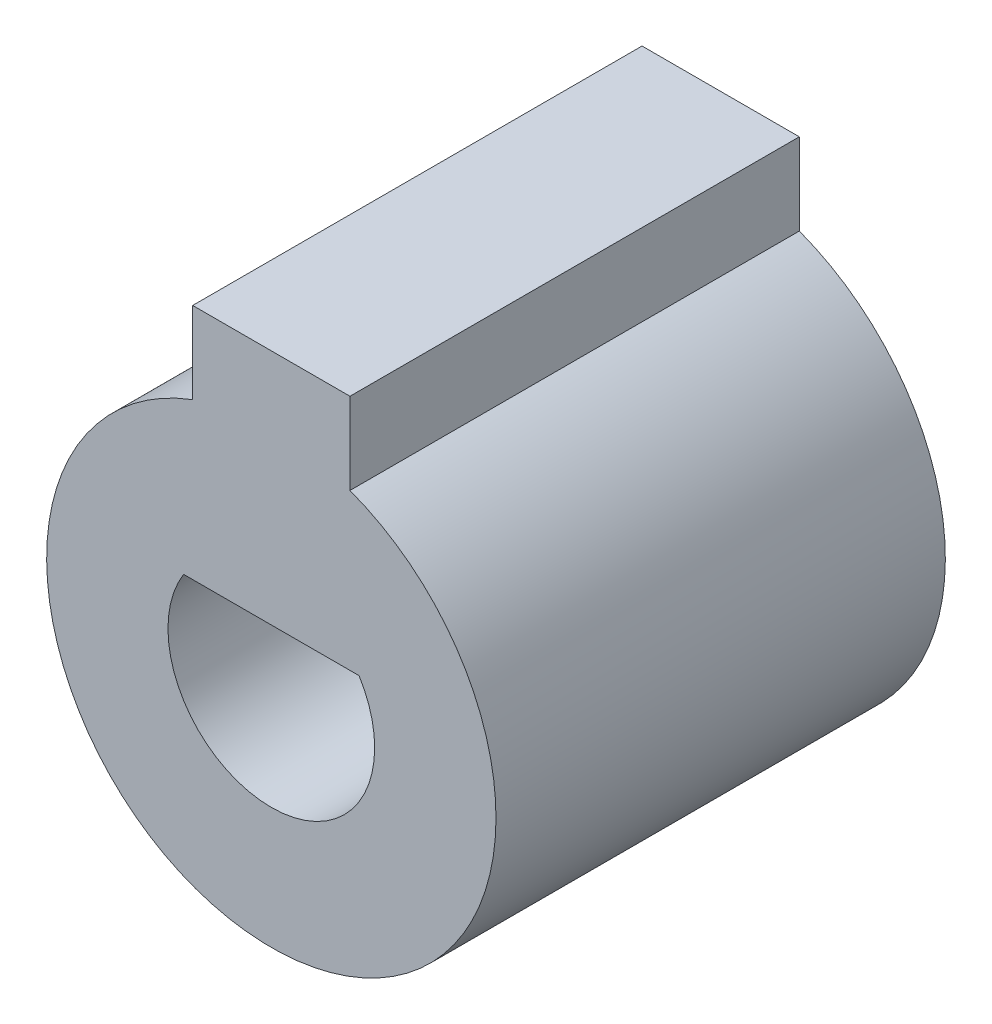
from build123d import *

# Parameters (mm, degrees)
BOSS_EXTRUDE1_DEPTH = 10


with BuildPart() as part:
    # Sketch2 → Boss-Extrude1 (new body)
    with BuildSketch(Plane.XY):
        with BuildLine():
            ThreePointArc((0, 5), (0.889173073, 4.920301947), (1.75, 4.683748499))
            Line((1.75, 4.683748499), (1.75, 6.5))
            Line((1.75, 6.5), (0, 6.5))
            Line((0, 6.5), (0, 5))
        make_face()
        with BuildLine():
            ThreePointArc((-1.75, 4.683748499), (-0.889173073, 4.920301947), (0, 5))
            Line((0, 5), (0, 6.5))
            Line((0, 6.5), (-1.75, 6.5))
            Line((-1.75, 6.5), (-1.75, 4.683748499))
        make_face()
        with BuildLine():
            ThreePointArc((1.75, 1.492481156), (1.856113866, 1.358249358), (1.95195478, 1.216500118))
            ThreePointArc((1.95195478, 1.216500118), (2.211277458, 0.632654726), (2.3, 0))
            ThreePointArc((2.3, 0), (-0.632654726, -2.211277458), (-1.95195478, 1.216500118))
            ThreePointArc((-1.95195478, 1.216500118), (-1.856113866, 1.358249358), (-1.75, 1.492481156))
            Line((-1.75, 1.492481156), (-1.75, 4.683748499))
            ThreePointArc((-1.75, 4.683748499), (-2.850438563, -4.107919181), (5, 0))
            ThreePointArc((5, 0), (4.107919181, 2.850438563), (1.75, 4.683748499))
            Line((1.75, 4.683748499), (1.75, 1.492481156))
        make_face()
        with BuildLine():
            ThreePointArc((-1.75, 1.492481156), (-0.963663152, 2.08838534), (0, 2.3))
            Line((0, 2.3), (0, 5))
            ThreePointArc((0, 5), (-0.889173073, 4.920301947), (-1.75, 4.683748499))
            Line((-1.75, 4.683748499), (-1.75, 1.492481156))
        make_face()
        with BuildLine():
            ThreePointArc((0, 2.3), (0.963663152, 2.08838534), (1.75, 1.492481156))
            Line((1.75, 1.492481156), (1.75, 4.683748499))
            ThreePointArc((1.75, 4.683748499), (0.889173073, 4.920301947), (0, 5))
            Line((0, 5), (0, 2.3))
        make_face()
        with BuildLine():
            Line((0, 1.216500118), (1.75, 1.216500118))
            Line((1.75, 1.216500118), (1.75, 1.492481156))
            ThreePointArc((1.75, 1.492481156), (0.963663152, 2.08838534), (0, 2.3))
            Line((0, 2.3), (0, 1.216500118))
        make_face()
        with BuildLine():
            Line((-1.75, 1.216500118), (0, 1.216500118))
            Line((0, 1.216500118), (0, 2.3))
            ThreePointArc((0, 2.3), (-0.963663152, 2.08838534), (-1.75, 1.492481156))
            Line((-1.75, 1.492481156), (-1.75, 1.216500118))
        make_face()
        with BuildLine():
            ThreePointArc((-1.75, 1.492481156), (-1.856113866, 1.358249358), (-1.95195478, 1.216500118))
            Line((-1.95195478, 1.216500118), (-1.75, 1.216500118))
            Line((-1.75, 1.216500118), (-1.75, 1.492481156))
        make_face()
        with BuildLine():
            Line((1.75, 1.216500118), (1.95195478, 1.216500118))
            ThreePointArc((1.95195478, 1.216500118), (1.856113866, 1.358249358), (1.75, 1.492481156))
            Line((1.75, 1.492481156), (1.75, 1.216500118))
        make_face()
    extrude(amount=BOSS_EXTRUDE1_DEPTH)


solid = part.part
